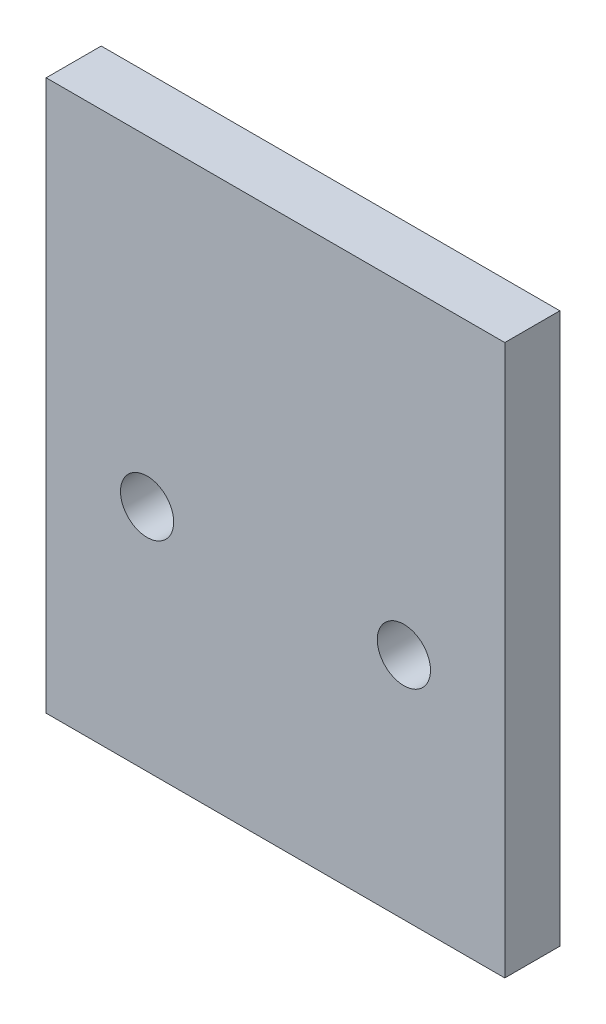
from build123d import *

# Parameters (mm, degrees)
SKETCH_1_W      = 25
SKETCH_1_H      = 30
SKETCH_1_R      = 1.45
EXTRUDE_1_DEPTH = 3


with BuildPart() as part:
    # Sketch 1 → Extrude 1 (new body)
    with BuildSketch(Plane.XY):
        with Locations((12.5, 15)):
            Rectangle(SKETCH_1_W, SKETCH_1_H)
        with Locations((19.5, 12.5)):
            Circle(SKETCH_1_R, mode=Mode.SUBTRACT)
        with Locations(Location((5.5, 12.5, 0), (0, 0, 180))):
            Circle(SKETCH_1_R, mode=Mode.SUBTRACT)
    extrude(amount=EXTRUDE_1_DEPTH)


solid = part.part
